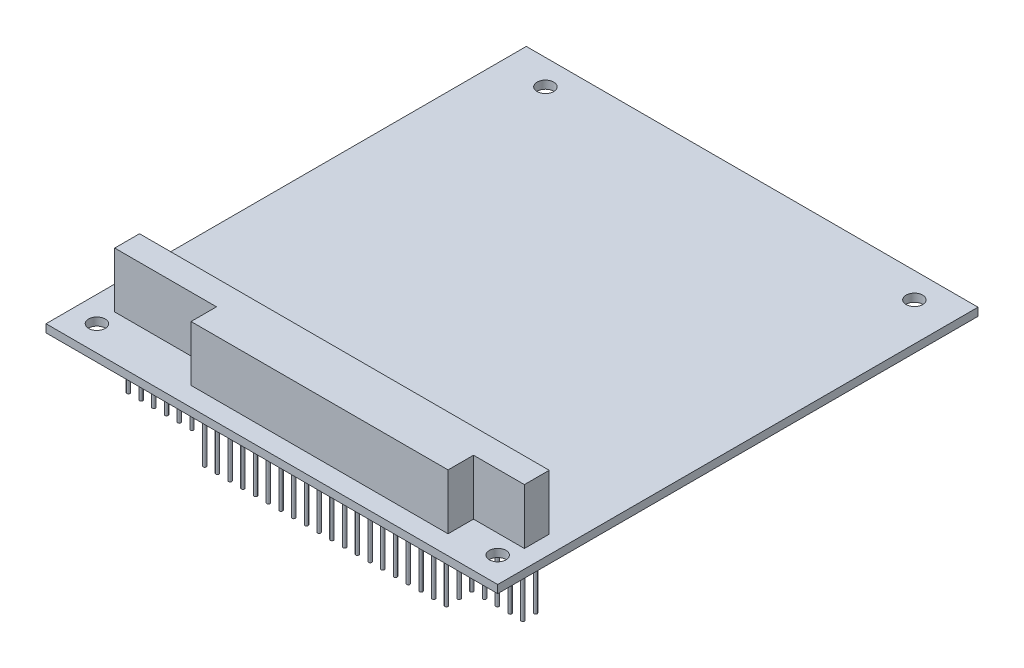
from build123d import *

# Parameters (mm, degrees)
SKETCH1_W            = 90.17
SKETCH1_H            = 95.885
SKETCH1_R            = 1.651
EXTRUDE1_DEPTH       = 1.5875
EXTRUDE2_DEPTH       = 11.049
SKETCH4_R            = 0.3175
EXTRUDE3_DEPTH       = 12.192
LPATTERN1_COUNT      = 32
LPATTERN1_PITCH      = 2.54
LPATTERN1_COUNT_DIR2 = 4
LPATTERN1_PITCH_DIR2 = 2.54


with BuildPart() as part:
    # Sketch1 → Extrude1 (new body)
    with BuildSketch(Plane(origin=(0, 0, 0), x_dir=(1, 0, 0), z_dir=(0, 1, 0))):
        Rectangle(SKETCH1_W, SKETCH1_H)
        with Locations(Location((-40.005, -42.8625, 0), (0, 0, 270))):
            Circle(SKETCH1_R, mode=Mode.SUBTRACT)
        with Locations(Location((40.005, -42.8625, 0), (0, 0, 270))):
            Circle(SKETCH1_R, mode=Mode.SUBTRACT)
        with Locations(Location((-36.195, 42.8625, 0), (0, 0, 270))):
            Circle(SKETCH1_R, mode=Mode.SUBTRACT)
        with Locations(Location((37.465, 42.8625, 0), (0, 0, 270))):
            Circle(SKETCH1_R, mode=Mode.SUBTRACT)
    extrude(amount=EXTRUDE1_DEPTH)

    # Sketch3 → Extrude2 (add)
    with BuildSketch(Plane(origin=(0, 1.5875, 0), x_dir=(-1, 0, 0), z_dir=(0, 1, 0))):
        Polygon((19.939, 44.1325), (19.939, 39.0525), (40.259, 39.0525), (40.259, 34.0995), (-41.529, 34.0995), (-41.529, 39.0525), (-31.369, 39.0525), (-31.369, 44.1325), align=None)
    extrude(amount=EXTRUDE2_DEPTH)

    # Sketch4 → Extrude3 (add)
    with BuildSketch(Plane.XZ):
        with Locations(Location((40.005, 35.306, 0), (0, 0, 90))):
            Circle(SKETCH4_R)
    extrude3 = extrude(amount=EXTRUDE3_DEPTH)

    # LPattern1: Extrude3 32 × 4, 24 skipped
    with Locations(*[(-i * LPATTERN1_PITCH, 0, j * LPATTERN1_PITCH_DIR2) for i in range(LPATTERN1_COUNT) for j in range(LPATTERN1_COUNT_DIR2) if (i, j) not in ((0, 0), (0, 2), (0, 3), (1, 2), (1, 3), (2, 2), (2, 3), (3, 2), (3, 3), (24, 2), (24, 3), (25, 2), (25, 3), (26, 2), (26, 3), (27, 2), (27, 3), (28, 2), (28, 3), (29, 2), (29, 3), (30, 2), (30, 3), (31, 2), (31, 3))]):
        add(extrude3)


solid = part.part
